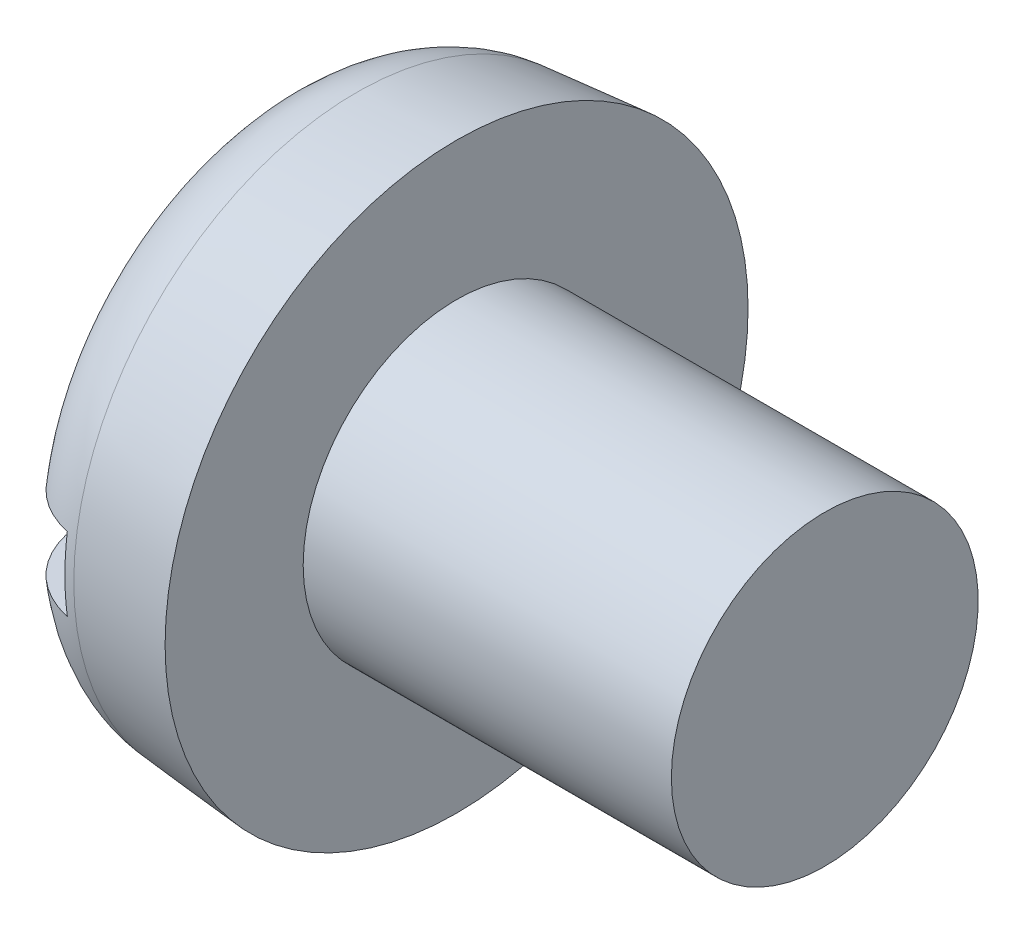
from build123d import *

# Parameters (mm, degrees)
FILLET2_R  = 1.5
SKETCH2_W  = 9.5
SKETCH2_H  = 1.2
SLOT_DEPTH = 1.2


with BuildPart() as part:
    # BodySke → Base-Revolve (revolve)
    with BuildSketch(Plane.XY, mode=Mode.PRIVATE) as base_revolve_sk:
        Polygon((3, 2.5), (3, 4.75), (0, 4.487534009), (0, 0), (9, 0), (9, 2.5), align=None)
    revolve(base_revolve_sk.sketch.rotate(Axis((-25.4, 0, 0), (1, 0, 0)), 90), axis=Axis((-25.4, 0, 0), (1, 0, 0)))

    # Fillet2
    fillet2_edges = [part.edges().sort_by_distance(p)[0] for p in [
        (0, 0, -4.487534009),
    ]]
    fillet(fillet2_edges, radius=FILLET2_R)

    # Sketch2 → Slot (cut)
    with BuildSketch(Plane(origin=(0, 0, 0), x_dir=(0, 0, -1), z_dir=(1, 0, 0))):
        Rectangle(SKETCH2_W, SKETCH2_H)
    extrude(amount=SLOT_DEPTH, mode=Mode.SUBTRACT)


solid = part.part
